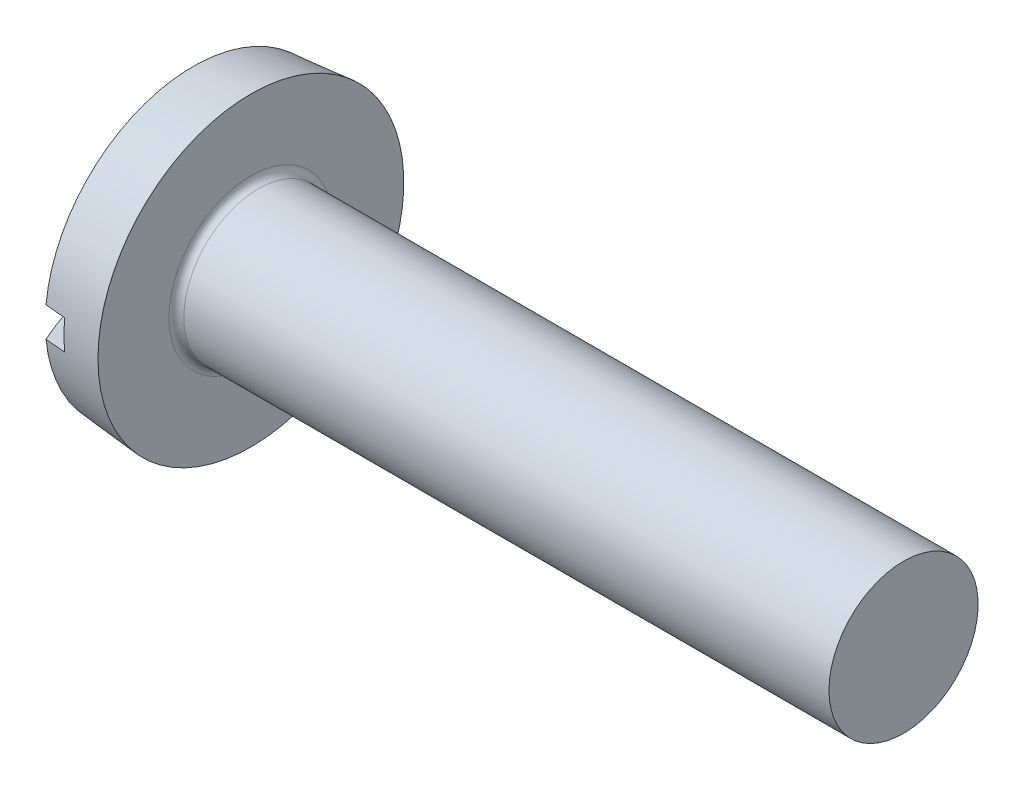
ISO-10303-21;
HEADER;
FILE_DESCRIPTION(('STEP AP214'),'2;1');
FILE_NAME('part.step','',(''),(''),'','','');
FILE_SCHEMA(('AUTOMOTIVE_DESIGN { 1 0 10303 214 1 1 1 1 }'));
ENDSEC;
DATA;
#1=APPLICATION_CONTEXT('core data for automotive mechanical design processes');
#2=APPLICATION_PROTOCOL_DEFINITION('international standard','automotive_design',2000,#1);
#3=PRODUCT_CONTEXT('',#1,'mechanical');
#4=PRODUCT('Part','Part','',(#3));
#5=PRODUCT_RELATED_PRODUCT_CATEGORY('part','',(#4));
#6=PRODUCT_DEFINITION_FORMATION('','',#4);
#7=PRODUCT_DEFINITION_CONTEXT('part definition',#1,'design');
#8=PRODUCT_DEFINITION('design','',#6,#7);
#9=PRODUCT_DEFINITION_SHAPE('','',#8);
#10=(LENGTH_UNIT() NAMED_UNIT(*) SI_UNIT(.MILLI.,.METRE.));
#11=(NAMED_UNIT(*) PLANE_ANGLE_UNIT() SI_UNIT($,.RADIAN.));
#12=(NAMED_UNIT(*) SI_UNIT($,.STERADIAN.) SOLID_ANGLE_UNIT());
#13=UNCERTAINTY_MEASURE_WITH_UNIT(LENGTH_MEASURE(1.E-05),#10,'distance_accuracy_value','');
#14=(GEOMETRIC_REPRESENTATION_CONTEXT(3) GLOBAL_UNCERTAINTY_ASSIGNED_CONTEXT((#13)) GLOBAL_UNIT_ASSIGNED_CONTEXT((#10,
#11,#12)) REPRESENTATION_CONTEXT('',''));
#15=CARTESIAN_POINT('',(0.,0.,0.));
#16=DIRECTION('',(0.,0.,1.));
#17=DIRECTION('',(1.,0.,0.));
#18=AXIS2_PLACEMENT_3D('',#15,#16,#17);
#19=CARTESIAN_POINT('',(19.343972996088,0.,0.));
#20=DIRECTION('',(-1.,0.,0.));
#21=DIRECTION('',(0.,1.,0.));
#22=AXIS2_PLACEMENT_3D('',#19,#20,#21);
#23=SPHERICAL_SURFACE('',#22,19.343972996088);
#24=CARTESIAN_POINT('',(1.7,0.,0.));
#25=DIRECTION('',(-1.,0.,0.));
#26=DIRECTION('',(0.,0.,1.));
#27=AXIS2_PLACEMENT_3D('',#24,#25,#26);
#28=CIRCLE('',#27,7.92966002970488);
#29=CARTESIAN_POINT('',(1.7,-0.8,-7.88920199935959));
#30=VERTEX_POINT('',#29);
#31=CARTESIAN_POINT('',(1.7,-0.8,7.88920199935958));
#32=VERTEX_POINT('',#31);
#33=EDGE_CURVE('E122',#30,#32,#28,.T.);
#34=ORIENTED_EDGE('',*,*,#33,.T.);
#35=CARTESIAN_POINT('',(19.343972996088,-0.8,0.));
#36=DIRECTION('',(0.,1.,0.));
#37=DIRECTION('',(0.,0.,1.));
#38=AXIS2_PLACEMENT_3D('',#35,#36,#37);
#39=CIRCLE('',#38,19.3274232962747);
#40=EDGE_CURVE('E89',#32,#30,#39,.F.);
#41=ORIENTED_EDGE('',*,*,#40,.T.);
#42=EDGE_LOOP('',(#34,#41));
#43=FACE_BOUND('',#42,.T.);
#44=ADVANCED_FACE('F41',(#43),#23,.T.);
#45=CARTESIAN_POINT('',(1.7,0.799999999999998,7.88920199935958));
#46=VERTEX_POINT('',#45);
#47=CARTESIAN_POINT('',(1.7,0.8,-7.88920199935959));
#48=VERTEX_POINT('',#47);
#49=EDGE_CURVE('E119',#46,#48,#28,.T.);
#50=ORIENTED_EDGE('',*,*,#49,.T.);
#51=CARTESIAN_POINT('',(19.343972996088,0.799999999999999,0.));
#52=DIRECTION('',(0.,-1.,0.));
#53=DIRECTION('',(0.,0.,-1.));
#54=AXIS2_PLACEMENT_3D('',#51,#52,#53);
#55=CIRCLE('',#54,19.3274232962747);
#56=EDGE_CURVE('E130',#48,#46,#55,.F.);
#57=ORIENTED_EDGE('',*,*,#56,.T.);
#58=EDGE_LOOP('',(#50,#57));
#59=FACE_BOUND('',#58,.T.);
#60=ADVANCED_FACE('F136',(#59),#23,.T.);
#61=CARTESIAN_POINT('',(4.79,0.,0.));
#62=DIRECTION('',(1.,0.,0.));
#63=DIRECTION('',(0.,0.,-1.));
#64=AXIS2_PLACEMENT_3D('',#61,#62,#63);
#65=CONICAL_SURFACE('',#64,8.2,0.0872664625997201);
#66=CARTESIAN_POINT('',(4.79,0.,0.));
#67=DIRECTION('',(-1.,0.,0.));
#68=DIRECTION('',(0.,0.,1.));
#69=AXIS2_PLACEMENT_3D('',#66,#67,#68);
#70=CIRCLE('',#69,8.2);
#71=CARTESIAN_POINT('',(4.79,0.,8.2));
#72=VERTEX_POINT('',#71);
#73=EDGE_CURVE('E123',#72,#72,#70,.T.);
#74=ORIENTED_EDGE('',*,*,#73,.T.);
#75=EDGE_LOOP('',(#74));
#76=FACE_BOUND('',#75,.T.);
#77=CARTESIAN_POINT('',(-12.5012868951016,-0.8,6.63918341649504));
#78=CARTESIAN_POINT('',(-8.41637899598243,-0.8,6.99913537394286));
#79=CARTESIAN_POINT('',(-4.33143795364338,-0.8,7.35871084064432));
#80=CARTESIAN_POINT('',(0.533525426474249,-0.8,7.78662192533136));
#81=CARTESIAN_POINT('',(1.31352477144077,-0.8,7.85521892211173));
#82=CARTESIAN_POINT('',(6.95849874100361,-0.8,8.35159903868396));
#83=CARTESIAN_POINT('',(11.8235038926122,-0.8,8.77903505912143));
#84=CARTESIAN_POINT('',(16.6885247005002,-0.8,9.2062925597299));
#85=B_SPLINE_CURVE_WITH_KNOTS('',3,(#77,#78,#79,#80,#81,#82,#83,#84),.UNSPECIFIED.,.F.,.F.,(4,2,
2,4),(0.,12.3022087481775,14.6512384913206,29.302476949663),.UNSPECIFIED.);
#86=CARTESIAN_POINT('',(2.8,-0.8,7.98592709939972));
#87=VERTEX_POINT('',#86);
#88=EDGE_CURVE('E11',#32,#87,#85,.T.);
#89=ORIENTED_EDGE('',*,*,#88,.F.);
#90=ORIENTED_EDGE('',*,*,#33,.F.);
#91=CARTESIAN_POINT('',(16.6885247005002,-0.8,-9.2062925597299));
#92=CARTESIAN_POINT('',(14.2560135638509,-0.8,-8.99267204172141));
#93=CARTESIAN_POINT('',(11.8235070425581,-0.8,-8.77899895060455));
#94=CARTESIAN_POINT('',(6.95850614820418,-0.8,-8.35151466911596));
#95=CARTESIAN_POINT('',(4.52601177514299,-0.8,-8.13770347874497));
#96=CARTESIAN_POINT('',(-0.338961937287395,-0.8,-7.70991004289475));
#97=CARTESIAN_POINT('',(-2.77144127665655,-0.8,-7.49592779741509));
#98=CARTESIAN_POINT('',(-7.63638014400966,-0.8,-7.06773807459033));
#99=CARTESIAN_POINT('',(-10.0688396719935,-0.8,-6.85353059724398));
#100=CARTESIAN_POINT('',(-12.5012868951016,-0.8,-6.63918341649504));
#101=B_SPLINE_CURVE_WITH_KNOTS('',3,(#91,#92,#93,#94,#95,#96,#97,#98,#99,#100),.UNSPECIFIED.,
.F.,.F.,(4,2,2,2,4),(0.,7.32561925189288,14.6512384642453,21.9768576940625,29.3024769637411),.UNSPECIFIED.);
#102=CARTESIAN_POINT('',(2.8,-0.8,-7.98592709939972));
#103=VERTEX_POINT('',#102);
#104=EDGE_CURVE('E70',#103,#30,#101,.T.);
#105=ORIENTED_EDGE('',*,*,#104,.F.);
#106=CARTESIAN_POINT('',(2.8,0.,0.));
#107=DIRECTION('',(1.,0.,0.));
#108=DIRECTION('',(0.,0.,-1.));
#109=AXIS2_PLACEMENT_3D('',#106,#107,#108);
#110=CIRCLE('',#109,8.0258975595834);
#111=CARTESIAN_POINT('',(2.8,0.8,-7.98592709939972));
#112=VERTEX_POINT('',#111);
#113=EDGE_CURVE('E97',#103,#112,#110,.T.);
#114=ORIENTED_EDGE('',*,*,#113,.T.);
#115=CARTESIAN_POINT('',(-12.5012868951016,0.8,-6.63918341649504));
#116=CARTESIAN_POINT('',(-8.41637899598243,0.8,-6.99913537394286));
#117=CARTESIAN_POINT('',(-4.33143795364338,0.8,-7.35871084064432));
#118=CARTESIAN_POINT('',(0.533525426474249,0.8,-7.78662192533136));
#119=CARTESIAN_POINT('',(1.31352477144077,0.8,-7.85521892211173));
#120=CARTESIAN_POINT('',(6.95849874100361,0.8,-8.35159903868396));
#121=CARTESIAN_POINT('',(11.8235038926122,0.8,-8.77903505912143));
#122=CARTESIAN_POINT('',(16.6885247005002,0.8,-9.2062925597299));
#123=B_SPLINE_CURVE_WITH_KNOTS('',3,(#115,#116,#117,#118,#119,#120,#121,#122),.UNSPECIFIED.,.F.,
.F.,(4,2,2,4),(0.,12.3022087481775,14.6512384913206,29.302476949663),.UNSPECIFIED.);
#124=EDGE_CURVE('E103',#48,#112,#123,.T.);
#125=ORIENTED_EDGE('',*,*,#124,.F.);
#126=ORIENTED_EDGE('',*,*,#49,.F.);
#127=CARTESIAN_POINT('',(16.6885247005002,0.799999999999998,9.2062925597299));
#128=CARTESIAN_POINT('',(14.2560135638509,0.799999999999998,8.99267204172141));
#129=CARTESIAN_POINT('',(11.8235070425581,0.799999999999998,8.77899895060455));
#130=CARTESIAN_POINT('',(6.95850614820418,0.799999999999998,8.35151466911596));
#131=CARTESIAN_POINT('',(4.52601177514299,0.799999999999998,8.13770347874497));
#132=CARTESIAN_POINT('',(-0.338961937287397,0.799999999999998,7.70991004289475));
#133=CARTESIAN_POINT('',(-2.77144127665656,0.799999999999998,7.49592779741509));
#134=CARTESIAN_POINT('',(-7.63638014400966,0.799999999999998,7.06773807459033));
#135=CARTESIAN_POINT('',(-10.0688396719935,0.799999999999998,6.85353059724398));
#136=CARTESIAN_POINT('',(-12.5012868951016,0.799999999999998,6.63918341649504));
#137=B_SPLINE_CURVE_WITH_KNOTS('',3,(#127,#128,#129,#130,#131,#132,#133,#134,#135,#136),
.UNSPECIFIED.,.F.,.F.,(4,2,2,2,4),(0.,7.32561925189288,14.6512384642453,21.9768576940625,
29.3024769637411),.UNSPECIFIED.);
#138=CARTESIAN_POINT('',(2.8,0.799999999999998,7.98592709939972));
#139=VERTEX_POINT('',#138);
#140=EDGE_CURVE('E55',#139,#46,#137,.T.);
#141=ORIENTED_EDGE('',*,*,#140,.F.);
#142=EDGE_CURVE('E95',#139,#87,#110,.T.);
#143=ORIENTED_EDGE('',*,*,#142,.T.);
#144=EDGE_LOOP('',(#89,#90,#105,#114,#125,#126,#141,#143));
#145=FACE_BOUND('',#144,.T.);
#146=ADVANCED_FACE('F100',(#76,#145),#65,.T.);
#147=CARTESIAN_POINT('',(-25.4,0.,0.));
#148=DIRECTION('',(-1.,0.,0.));
#149=DIRECTION('',(0.,0.,1.));
#150=AXIS2_PLACEMENT_3D('',#147,#148,#149);
#151=CYLINDRICAL_SURFACE('',#150,4.);
#152=CARTESIAN_POINT('',(5.2,0.,0.));
#153=DIRECTION('',(-1.,0.,0.));
#154=DIRECTION('',(0.,0.,1.));
#155=AXIS2_PLACEMENT_3D('',#152,#153,#154);
#156=CIRCLE('',#155,4.);
#157=CARTESIAN_POINT('',(5.2,0.,4.));
#158=VERTEX_POINT('',#157);
#159=EDGE_CURVE('E107',#158,#158,#156,.F.);
#160=ORIENTED_EDGE('',*,*,#159,.T.);
#161=EDGE_LOOP('',(#160));
#162=FACE_BOUND('',#161,.T.);
#163=CARTESIAN_POINT('',(39.8,0.,0.));
#164=DIRECTION('',(-1.,0.,0.));
#165=DIRECTION('',(0.,0.,1.));
#166=AXIS2_PLACEMENT_3D('',#163,#164,#165);
#167=CIRCLE('',#166,4.);
#168=CARTESIAN_POINT('',(39.8,0.,4.));
#169=VERTEX_POINT('',#168);
#170=EDGE_CURVE('E114',#169,#169,#167,.T.);
#171=ORIENTED_EDGE('',*,*,#170,.T.);
#172=EDGE_LOOP('',(#171));
#173=FACE_BOUND('',#172,.T.);
#174=ADVANCED_FACE('F143',(#162,#173),#151,.T.);
#175=CARTESIAN_POINT('',(39.8,4.,0.));
#176=DIRECTION('',(1.,0.,0.));
#177=DIRECTION('',(0.,0.,-1.));
#178=AXIS2_PLACEMENT_3D('',#175,#176,#177);
#179=PLANE('',#178);
#180=ORIENTED_EDGE('',*,*,#170,.F.);
#181=EDGE_LOOP('',(#180));
#182=FACE_BOUND('',#181,.T.);
#183=ADVANCED_FACE('F149',(#182),#179,.T.);
#184=CARTESIAN_POINT('',(-25.4,0.,0.));
#185=DIRECTION('',(-1.,0.,0.));
#186=DIRECTION('',(0.,0.,1.));
#187=AXIS2_PLACEMENT_3D('',#184,#185,#186);
#188=CYLINDRICAL_SURFACE('',#187,8.2);
#189=ORIENTED_EDGE('',*,*,#73,.F.);
#190=EDGE_LOOP('',(#189));
#191=FACE_BOUND('',#190,.T.);
#192=CARTESIAN_POINT('',(4.8,0.,0.));
#193=DIRECTION('',(-1.,0.,0.));
#194=DIRECTION('',(0.,0.,1.));
#195=AXIS2_PLACEMENT_3D('',#192,#193,#194);
#196=CIRCLE('',#195,8.2);
#197=CARTESIAN_POINT('',(4.8,0.,8.2));
#198=VERTEX_POINT('',#197);
#199=EDGE_CURVE('E126',#198,#198,#196,.T.);
#200=ORIENTED_EDGE('',*,*,#199,.T.);
#201=EDGE_LOOP('',(#200));
#202=FACE_BOUND('',#201,.T.);
#203=ADVANCED_FACE('F151',(#191,#202),#188,.T.);
#204=CARTESIAN_POINT('',(4.8,4.,0.));
#205=DIRECTION('',(-1.,0.,0.));
#206=DIRECTION('',(0.,0.,1.));
#207=AXIS2_PLACEMENT_3D('',#204,#205,#206);
#208=PLANE('',#207);
#209=CARTESIAN_POINT('',(4.8,0.,0.));
#210=DIRECTION('',(-1.,0.,0.));
#211=DIRECTION('',(0.,0.,1.));
#212=AXIS2_PLACEMENT_3D('',#209,#210,#211);
#213=CIRCLE('',#212,4.4);
#214=CARTESIAN_POINT('',(4.8,0.,4.4));
#215=VERTEX_POINT('',#214);
#216=EDGE_CURVE('E110',#215,#215,#213,.T.);
#217=ORIENTED_EDGE('',*,*,#216,.T.);
#218=EDGE_LOOP('',(#217));
#219=FACE_BOUND('',#218,.T.);
#220=ORIENTED_EDGE('',*,*,#199,.F.);
#221=EDGE_LOOP('',(#220));
#222=FACE_BOUND('',#221,.T.);
#223=ADVANCED_FACE('F168',(#219,#222),#208,.F.);
#224=CARTESIAN_POINT('',(5.2,0.,0.));
#225=DIRECTION('',(-1.,0.,0.));
#226=DIRECTION('',(0.,0.,1.));
#227=AXIS2_PLACEMENT_3D('',#224,#225,#226);
#228=TOROIDAL_SURFACE('',#227,4.4,0.4);
#229=ORIENTED_EDGE('',*,*,#159,.F.);
#230=EDGE_LOOP('',(#229));
#231=FACE_BOUND('',#230,.T.);
#232=ORIENTED_EDGE('',*,*,#216,.F.);
#233=EDGE_LOOP('',(#232));
#234=FACE_BOUND('',#233,.T.);
#235=ADVANCED_FACE('F43',(#231,#234),#228,.F.);
#236=CARTESIAN_POINT('',(2.8,-0.8,8.2));
#237=DIRECTION('',(0.,1.,0.));
#238=DIRECTION('',(0.,0.,1.));
#239=AXIS2_PLACEMENT_3D('',#236,#237,#238);
#240=PLANE('',#239);
#241=ORIENTED_EDGE('',*,*,#104,.T.);
#242=ORIENTED_EDGE('',*,*,#40,.F.);
#243=ORIENTED_EDGE('',*,*,#88,.T.);
#244=DIRECTION('',(0.,0.,-1.));
#245=VECTOR('',#244,1.);
#246=CARTESIAN_POINT('',(2.8,-0.8,8.2));
#247=LINE('',#246,#245);
#248=EDGE_CURVE('E88',#87,#103,#247,.T.);
#249=ORIENTED_EDGE('',*,*,#248,.T.);
#250=EDGE_LOOP('',(#241,#242,#243,#249));
#251=FACE_BOUND('',#250,.T.);
#252=ADVANCED_FACE('F87',(#251),#240,.T.);
#253=CARTESIAN_POINT('',(2.8,0.8,-8.2));
#254=DIRECTION('',(0.,-1.,0.));
#255=DIRECTION('',(0.,0.,-1.));
#256=AXIS2_PLACEMENT_3D('',#253,#254,#255);
#257=PLANE('',#256);
#258=ORIENTED_EDGE('',*,*,#124,.T.);
#259=DIRECTION('',(0.,0.,1.));
#260=VECTOR('',#259,1.);
#261=CARTESIAN_POINT('',(2.8,0.8,-8.2));
#262=LINE('',#261,#260);
#263=EDGE_CURVE('E62',#112,#139,#262,.T.);
#264=ORIENTED_EDGE('',*,*,#263,.T.);
#265=ORIENTED_EDGE('',*,*,#140,.T.);
#266=ORIENTED_EDGE('',*,*,#56,.F.);
#267=EDGE_LOOP('',(#258,#264,#265,#266));
#268=FACE_BOUND('',#267,.T.);
#269=ADVANCED_FACE('F134',(#268),#257,.T.);
#270=CARTESIAN_POINT('',(2.8,-0.8,-8.2));
#271=DIRECTION('',(1.,0.,0.));
#272=DIRECTION('',(0.,0.,-1.));
#273=AXIS2_PLACEMENT_3D('',#270,#271,#272);
#274=PLANE('',#273);
#275=ORIENTED_EDGE('',*,*,#263,.F.);
#276=ORIENTED_EDGE('',*,*,#113,.F.);
#277=ORIENTED_EDGE('',*,*,#248,.F.);
#278=ORIENTED_EDGE('',*,*,#142,.F.);
#279=EDGE_LOOP('',(#275,#276,#277,#278));
#280=FACE_BOUND('',#279,.T.);
#281=ADVANCED_FACE('F94',(#280),#274,.F.);
#282=CLOSED_SHELL('',(#44,#60,#146,#174,#183,#203,#223,#235,#252,#269,#281));
#283=MANIFOLD_SOLID_BREP('B2',#282);
#284=ADVANCED_BREP_SHAPE_REPRESENTATION('',(#18,#283),#14);
#285=SHAPE_DEFINITION_REPRESENTATION(#9,#284);
ENDSEC;
END-ISO-10303-21;
